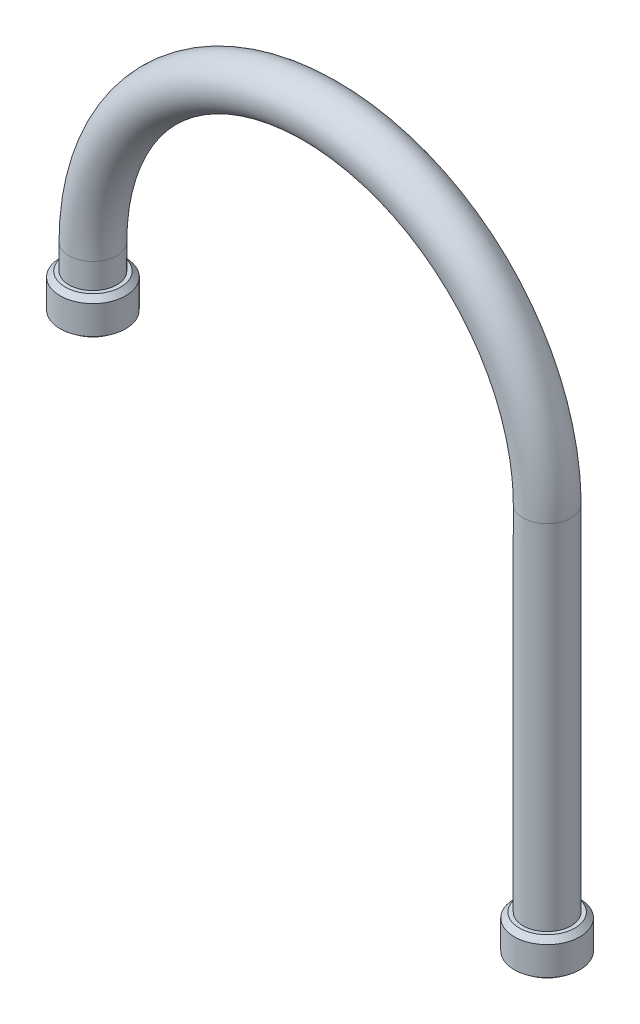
ISO-10303-21;
HEADER;
FILE_DESCRIPTION(('STEP AP214'),'2;1');
FILE_NAME('part.step','',(''),(''),'','','');
FILE_SCHEMA(('AUTOMOTIVE_DESIGN { 1 0 10303 214 1 1 1 1 }'));
ENDSEC;
DATA;
#1=APPLICATION_CONTEXT('core data for automotive mechanical design processes');
#2=APPLICATION_PROTOCOL_DEFINITION('international standard','automotive_design',2000,#1);
#3=PRODUCT_CONTEXT('',#1,'mechanical');
#4=PRODUCT('Part','Part','',(#3));
#5=PRODUCT_RELATED_PRODUCT_CATEGORY('part','',(#4));
#6=PRODUCT_DEFINITION_FORMATION('','',#4);
#7=PRODUCT_DEFINITION_CONTEXT('part definition',#1,'design');
#8=PRODUCT_DEFINITION('design','',#6,#7);
#9=PRODUCT_DEFINITION_SHAPE('','',#8);
#10=(LENGTH_UNIT() NAMED_UNIT(*) SI_UNIT(.MILLI.,.METRE.));
#11=(NAMED_UNIT(*) PLANE_ANGLE_UNIT() SI_UNIT($,.RADIAN.));
#12=(NAMED_UNIT(*) SI_UNIT($,.STERADIAN.) SOLID_ANGLE_UNIT());
#13=UNCERTAINTY_MEASURE_WITH_UNIT(LENGTH_MEASURE(1.E-05),#10,'distance_accuracy_value','');
#14=(GEOMETRIC_REPRESENTATION_CONTEXT(3) GLOBAL_UNCERTAINTY_ASSIGNED_CONTEXT((#13)) GLOBAL_UNIT_ASSIGNED_CONTEXT((#10,
#11,#12)) REPRESENTATION_CONTEXT('',''));
#15=CARTESIAN_POINT('',(0.,0.,0.));
#16=DIRECTION('',(0.,0.,1.));
#17=DIRECTION('',(1.,0.,0.));
#18=AXIS2_PLACEMENT_3D('',#15,#16,#17);
#19=CARTESIAN_POINT('',(0.,-2.,0.));
#20=DIRECTION('',(0.,-1.,0.));
#21=DIRECTION('',(0.,0.,-1.));
#22=AXIS2_PLACEMENT_3D('',#19,#20,#21);
#23=CYLINDRICAL_SURFACE('',#22,14.25);
#24=CARTESIAN_POINT('',(0.,20.,0.));
#25=DIRECTION('',(0.,-1.,0.));
#26=DIRECTION('',(0.,0.,-1.));
#27=AXIS2_PLACEMENT_3D('',#24,#25,#26);
#28=CIRCLE('',#27,14.25);
#29=CARTESIAN_POINT('',(0.,20.,-14.25));
#30=VERTEX_POINT('',#29);
#31=EDGE_CURVE('E26',#30,#30,#28,.T.);
#32=ORIENTED_EDGE('',*,*,#31,.F.);
#33=EDGE_LOOP('',(#32));
#34=FACE_BOUND('',#33,.T.);
#35=CARTESIAN_POINT('',(0.,35.,0.));
#36=DIRECTION('',(0.,-1.,0.));
#37=DIRECTION('',(0.,0.,-1.));
#38=AXIS2_PLACEMENT_3D('',#35,#36,#37);
#39=CIRCLE('',#38,14.25);
#40=CARTESIAN_POINT('',(0.,35.,-14.25));
#41=VERTEX_POINT('',#40);
#42=EDGE_CURVE('E10',#41,#41,#39,.T.);
#43=ORIENTED_EDGE('',*,*,#42,.T.);
#44=EDGE_LOOP('',(#43));
#45=FACE_BOUND('',#44,.T.);
#46=ADVANCED_FACE('F15',(#34,#45),#23,.T.);
#47=CARTESIAN_POINT('',(14.25,20.,0.));
#48=DIRECTION('',(0.,-1.,0.));
#49=DIRECTION('',(0.,0.,-1.));
#50=AXIS2_PLACEMENT_3D('',#47,#48,#49);
#51=PLANE('',#50);
#52=CARTESIAN_POINT('',(0.,20.,0.));
#53=DIRECTION('',(0.,-1.,0.));
#54=DIRECTION('',(0.,0.,-1.));
#55=AXIS2_PLACEMENT_3D('',#52,#53,#54);
#56=CIRCLE('',#55,16.5);
#57=CARTESIAN_POINT('',(0.,20.,-16.5));
#58=VERTEX_POINT('',#57);
#59=EDGE_CURVE('E87',#58,#58,#56,.T.);
#60=ORIENTED_EDGE('',*,*,#59,.F.);
#61=EDGE_LOOP('',(#60));
#62=FACE_BOUND('',#61,.T.);
#63=ORIENTED_EDGE('',*,*,#31,.T.);
#64=EDGE_LOOP('',(#63));
#65=FACE_BOUND('',#64,.T.);
#66=ADVANCED_FACE('F88',(#62,#65),#51,.F.);
#67=CARTESIAN_POINT('',(0.,20.,0.));
#68=DIRECTION('',(0.,-1.,0.));
#69=DIRECTION('',(0.,0.,-1.));
#70=AXIS2_PLACEMENT_3D('',#67,#68,#69);
#71=CONICAL_SURFACE('',#70,16.5,0.785398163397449);
#72=CARTESIAN_POINT('',(0.,17.,0.));
#73=DIRECTION('',(0.,-1.,0.));
#74=DIRECTION('',(0.,0.,-1.));
#75=AXIS2_PLACEMENT_3D('',#72,#73,#74);
#76=CIRCLE('',#75,19.5);
#77=CARTESIAN_POINT('',(0.,17.,-19.5));
#78=VERTEX_POINT('',#77);
#79=EDGE_CURVE('E92',#78,#78,#76,.T.);
#80=ORIENTED_EDGE('',*,*,#79,.F.);
#81=EDGE_LOOP('',(#80));
#82=FACE_BOUND('',#81,.T.);
#83=ORIENTED_EDGE('',*,*,#59,.T.);
#84=EDGE_LOOP('',(#83));
#85=FACE_BOUND('',#84,.T.);
#86=ADVANCED_FACE('F175',(#82,#85),#71,.T.);
#87=CARTESIAN_POINT('',(0.,-2.,0.));
#88=DIRECTION('',(0.,-1.,0.));
#89=DIRECTION('',(0.,0.,-1.));
#90=AXIS2_PLACEMENT_3D('',#87,#88,#89);
#91=CYLINDRICAL_SURFACE('',#90,19.5);
#92=CARTESIAN_POINT('',(0.,0.,0.));
#93=DIRECTION('',(0.,-1.,0.));
#94=DIRECTION('',(0.,0.,-1.));
#95=AXIS2_PLACEMENT_3D('',#92,#93,#94);
#96=CIRCLE('',#95,19.5);
#97=CARTESIAN_POINT('',(0.,0.,-19.5));
#98=VERTEX_POINT('',#97);
#99=EDGE_CURVE('E101',#98,#98,#96,.T.);
#100=ORIENTED_EDGE('',*,*,#99,.F.);
#101=EDGE_LOOP('',(#100));
#102=FACE_BOUND('',#101,.T.);
#103=ORIENTED_EDGE('',*,*,#79,.T.);
#104=EDGE_LOOP('',(#103));
#105=FACE_BOUND('',#104,.T.);
#106=ADVANCED_FACE('F186',(#102,#105),#91,.T.);
#107=CARTESIAN_POINT('',(19.5,0.,0.));
#108=DIRECTION('',(0.,1.,0.));
#109=DIRECTION('',(1.,0.,0.));
#110=AXIS2_PLACEMENT_3D('',#107,#108,#109);
#111=PLANE('',#110);
#112=CARTESIAN_POINT('',(0.,0.,0.));
#113=DIRECTION('',(0.,-1.,0.));
#114=DIRECTION('',(0.,0.,-1.));
#115=AXIS2_PLACEMENT_3D('',#112,#113,#114);
#116=CIRCLE('',#115,16.899);
#117=CARTESIAN_POINT('',(0.,0.,-16.899));
#118=VERTEX_POINT('',#117);
#119=EDGE_CURVE('E105',#118,#118,#116,.T.);
#120=ORIENTED_EDGE('',*,*,#119,.F.);
#121=EDGE_LOOP('',(#120));
#122=FACE_BOUND('',#121,.T.);
#123=ORIENTED_EDGE('',*,*,#99,.T.);
#124=EDGE_LOOP('',(#123));
#125=FACE_BOUND('',#124,.T.);
#126=ADVANCED_FACE('F183',(#122,#125),#111,.F.);
#127=CARTESIAN_POINT('',(0.,-2.,0.));
#128=DIRECTION('',(0.,-1.,0.));
#129=DIRECTION('',(0.,0.,-1.));
#130=AXIS2_PLACEMENT_3D('',#127,#128,#129);
#131=CYLINDRICAL_SURFACE('',#130,16.899);
#132=CARTESIAN_POINT('',(0.,-2.,0.));
#133=DIRECTION('',(0.,-1.,0.));
#134=DIRECTION('',(0.,0.,-1.));
#135=AXIS2_PLACEMENT_3D('',#132,#133,#134);
#136=CIRCLE('',#135,16.899);
#137=CARTESIAN_POINT('',(0.,-2.,-16.899));
#138=VERTEX_POINT('',#137);
#139=EDGE_CURVE('E135',#138,#138,#136,.T.);
#140=ORIENTED_EDGE('',*,*,#139,.F.);
#141=EDGE_LOOP('',(#140));
#142=FACE_BOUND('',#141,.T.);
#143=ORIENTED_EDGE('',*,*,#119,.T.);
#144=EDGE_LOOP('',(#143));
#145=FACE_BOUND('',#144,.T.);
#146=ADVANCED_FACE('F181',(#142,#145),#131,.T.);
#147=CARTESIAN_POINT('',(16.899,-2.,0.));
#148=DIRECTION('',(0.,1.,0.));
#149=DIRECTION('',(1.,0.,0.));
#150=AXIS2_PLACEMENT_3D('',#147,#148,#149);
#151=PLANE('',#150);
#152=ORIENTED_EDGE('',*,*,#139,.T.);
#153=EDGE_LOOP('',(#152));
#154=FACE_BOUND('',#153,.T.);
#155=ADVANCED_FACE('F165',(#154),#151,.F.);
#156=CARTESIAN_POINT('',(135.,35.,0.));
#157=DIRECTION('',(0.,0.,-1.));
#158=DIRECTION('',(-1.,0.,0.));
#159=AXIS2_PLACEMENT_3D('',#156,#157,#158);
#160=TOROIDAL_SURFACE('',#159,135.,14.25);
#161=ORIENTED_EDGE('',*,*,#42,.F.);
#162=EDGE_LOOP('',(#161));
#163=FACE_BOUND('',#162,.T.);
#164=CARTESIAN_POINT('',(270.,35.,0.));
#165=DIRECTION('',(0.,-1.,0.));
#166=DIRECTION('',(-1.,0.,0.));
#167=AXIS2_PLACEMENT_3D('',#164,#165,#166);
#168=CIRCLE('',#167,14.25);
#169=CARTESIAN_POINT('',(255.75,35.,0.));
#170=VERTEX_POINT('',#169);
#171=EDGE_CURVE('E139',#170,#170,#168,.T.);
#172=ORIENTED_EDGE('',*,*,#171,.F.);
#173=EDGE_LOOP('',(#172));
#174=FACE_BOUND('',#173,.T.);
#175=ADVANCED_FACE('F154',(#163,#174),#160,.T.);
#176=CARTESIAN_POINT('',(270.,-197.,0.));
#177=DIRECTION('',(0.,-1.,0.));
#178=DIRECTION('',(0.,0.,-1.));
#179=AXIS2_PLACEMENT_3D('',#176,#177,#178);
#180=CYLINDRICAL_SURFACE('',#179,14.25);
#181=CARTESIAN_POINT('',(270.,-175.,0.));
#182=DIRECTION('',(0.,-1.,0.));
#183=DIRECTION('',(0.,0.,-1.));
#184=AXIS2_PLACEMENT_3D('',#181,#182,#183);
#185=CIRCLE('',#184,14.25);
#186=CARTESIAN_POINT('',(270.,-175.,-14.25));
#187=VERTEX_POINT('',#186);
#188=EDGE_CURVE('E19',#187,#187,#185,.T.);
#189=ORIENTED_EDGE('',*,*,#188,.F.);
#190=EDGE_LOOP('',(#189));
#191=FACE_BOUND('',#190,.T.);
#192=ORIENTED_EDGE('',*,*,#171,.T.);
#193=EDGE_LOOP('',(#192));
#194=FACE_BOUND('',#193,.T.);
#195=ADVANCED_FACE('F152',(#191,#194),#180,.T.);
#196=CARTESIAN_POINT('',(284.25,-175.,0.));
#197=DIRECTION('',(0.,-1.,0.));
#198=DIRECTION('',(0.,0.,-1.));
#199=AXIS2_PLACEMENT_3D('',#196,#197,#198);
#200=PLANE('',#199);
#201=CARTESIAN_POINT('',(270.,-175.,0.));
#202=DIRECTION('',(0.,-1.,0.));
#203=DIRECTION('',(0.,0.,-1.));
#204=AXIS2_PLACEMENT_3D('',#201,#202,#203);
#205=CIRCLE('',#204,16.5);
#206=CARTESIAN_POINT('',(270.,-175.,-16.5));
#207=VERTEX_POINT('',#206);
#208=EDGE_CURVE('E106',#207,#207,#205,.T.);
#209=ORIENTED_EDGE('',*,*,#208,.F.);
#210=EDGE_LOOP('',(#209));
#211=FACE_BOUND('',#210,.T.);
#212=ORIENTED_EDGE('',*,*,#188,.T.);
#213=EDGE_LOOP('',(#212));
#214=FACE_BOUND('',#213,.T.);
#215=ADVANCED_FACE('F150',(#211,#214),#200,.F.);
#216=CARTESIAN_POINT('',(270.,-175.,0.));
#217=DIRECTION('',(0.,-1.,0.));
#218=DIRECTION('',(0.,0.,-1.));
#219=AXIS2_PLACEMENT_3D('',#216,#217,#218);
#220=CONICAL_SURFACE('',#219,16.5,0.785398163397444);
#221=CARTESIAN_POINT('',(270.,-178.,0.));
#222=DIRECTION('',(0.,-1.,0.));
#223=DIRECTION('',(0.,0.,-1.));
#224=AXIS2_PLACEMENT_3D('',#221,#222,#223);
#225=CIRCLE('',#224,19.5);
#226=CARTESIAN_POINT('',(270.,-178.,-19.5));
#227=VERTEX_POINT('',#226);
#228=EDGE_CURVE('E109',#227,#227,#225,.T.);
#229=ORIENTED_EDGE('',*,*,#228,.F.);
#230=EDGE_LOOP('',(#229));
#231=FACE_BOUND('',#230,.T.);
#232=ORIENTED_EDGE('',*,*,#208,.T.);
#233=EDGE_LOOP('',(#232));
#234=FACE_BOUND('',#233,.T.);
#235=ADVANCED_FACE('F162',(#231,#234),#220,.T.);
#236=CARTESIAN_POINT('',(270.,-197.,0.));
#237=DIRECTION('',(0.,-1.,0.));
#238=DIRECTION('',(0.,0.,-1.));
#239=AXIS2_PLACEMENT_3D('',#236,#237,#238);
#240=CYLINDRICAL_SURFACE('',#239,19.5);
#241=CARTESIAN_POINT('',(270.,-195.,0.));
#242=DIRECTION('',(0.,-1.,0.));
#243=DIRECTION('',(0.,0.,-1.));
#244=AXIS2_PLACEMENT_3D('',#241,#242,#243);
#245=CIRCLE('',#244,19.5);
#246=CARTESIAN_POINT('',(270.,-195.,-19.5));
#247=VERTEX_POINT('',#246);
#248=EDGE_CURVE('E110',#247,#247,#245,.T.);
#249=ORIENTED_EDGE('',*,*,#248,.F.);
#250=EDGE_LOOP('',(#249));
#251=FACE_BOUND('',#250,.T.);
#252=ORIENTED_EDGE('',*,*,#228,.T.);
#253=EDGE_LOOP('',(#252));
#254=FACE_BOUND('',#253,.T.);
#255=ADVANCED_FACE('F192',(#251,#254),#240,.T.);
#256=CARTESIAN_POINT('',(289.5,-195.,0.));
#257=DIRECTION('',(0.,1.,0.));
#258=DIRECTION('',(1.,0.,0.));
#259=AXIS2_PLACEMENT_3D('',#256,#257,#258);
#260=PLANE('',#259);
#261=CARTESIAN_POINT('',(270.,-195.,0.));
#262=DIRECTION('',(0.,-1.,0.));
#263=DIRECTION('',(0.,0.,-1.));
#264=AXIS2_PLACEMENT_3D('',#261,#262,#263);
#265=CIRCLE('',#264,16.899);
#266=CARTESIAN_POINT('',(270.,-195.,-16.899));
#267=VERTEX_POINT('',#266);
#268=EDGE_CURVE('E113',#267,#267,#265,.T.);
#269=ORIENTED_EDGE('',*,*,#268,.F.);
#270=EDGE_LOOP('',(#269));
#271=FACE_BOUND('',#270,.T.);
#272=ORIENTED_EDGE('',*,*,#248,.T.);
#273=EDGE_LOOP('',(#272));
#274=FACE_BOUND('',#273,.T.);
#275=ADVANCED_FACE('F248',(#271,#274),#260,.F.);
#276=CARTESIAN_POINT('',(270.,-197.,0.));
#277=DIRECTION('',(0.,-1.,0.));
#278=DIRECTION('',(0.,0.,-1.));
#279=AXIS2_PLACEMENT_3D('',#276,#277,#278);
#280=CYLINDRICAL_SURFACE('',#279,16.899);
#281=CARTESIAN_POINT('',(270.,-197.,0.));
#282=DIRECTION('',(0.,-1.,0.));
#283=DIRECTION('',(0.,0.,-1.));
#284=AXIS2_PLACEMENT_3D('',#281,#282,#283);
#285=CIRCLE('',#284,16.899);
#286=CARTESIAN_POINT('',(270.,-197.,-16.899));
#287=VERTEX_POINT('',#286);
#288=EDGE_CURVE('E122',#287,#287,#285,.T.);
#289=ORIENTED_EDGE('',*,*,#288,.F.);
#290=EDGE_LOOP('',(#289));
#291=FACE_BOUND('',#290,.T.);
#292=ORIENTED_EDGE('',*,*,#268,.T.);
#293=EDGE_LOOP('',(#292));
#294=FACE_BOUND('',#293,.T.);
#295=ADVANCED_FACE('F17',(#291,#294),#280,.T.);
#296=CARTESIAN_POINT('',(286.899,-197.,0.));
#297=DIRECTION('',(0.,1.,0.));
#298=DIRECTION('',(1.,0.,0.));
#299=AXIS2_PLACEMENT_3D('',#296,#297,#298);
#300=PLANE('',#299);
#301=ORIENTED_EDGE('',*,*,#288,.T.);
#302=EDGE_LOOP('',(#301));
#303=FACE_BOUND('',#302,.T.);
#304=ADVANCED_FACE('F232',(#303),#300,.F.);
#305=CLOSED_SHELL('',(#46,#66,#86,#106,#126,#146,#155,#175,#195,#215,#235,#255,#275,#295,#304));
#306=MANIFOLD_SOLID_BREP('B1',#305);
#307=ADVANCED_BREP_SHAPE_REPRESENTATION('',(#18,#306),#14);
#308=SHAPE_DEFINITION_REPRESENTATION(#9,#307);
ENDSEC;
END-ISO-10303-21;
